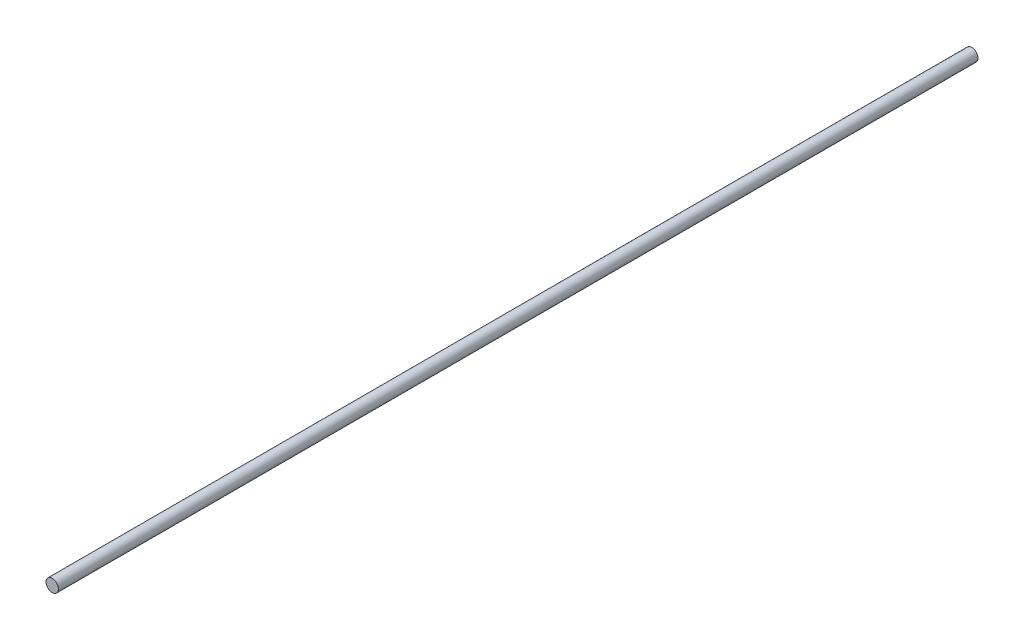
ISO-10303-21;
HEADER;
FILE_DESCRIPTION(('STEP AP214'),'2;1');
FILE_NAME('part.step','',(''),(''),'','','');
FILE_SCHEMA(('AUTOMOTIVE_DESIGN { 1 0 10303 214 1 1 1 1 }'));
ENDSEC;
DATA;
#1=APPLICATION_CONTEXT('core data for automotive mechanical design processes');
#2=APPLICATION_PROTOCOL_DEFINITION('international standard','automotive_design',2000,#1);
#3=PRODUCT_CONTEXT('',#1,'mechanical');
#4=PRODUCT('Part','Part','',(#3));
#5=PRODUCT_RELATED_PRODUCT_CATEGORY('part','',(#4));
#6=PRODUCT_DEFINITION_FORMATION('','',#4);
#7=PRODUCT_DEFINITION_CONTEXT('part definition',#1,'design');
#8=PRODUCT_DEFINITION('design','',#6,#7);
#9=PRODUCT_DEFINITION_SHAPE('','',#8);
#10=(LENGTH_UNIT() NAMED_UNIT(*) SI_UNIT(.MILLI.,.METRE.));
#11=(NAMED_UNIT(*) PLANE_ANGLE_UNIT() SI_UNIT($,.RADIAN.));
#12=(NAMED_UNIT(*) SI_UNIT($,.STERADIAN.) SOLID_ANGLE_UNIT());
#13=UNCERTAINTY_MEASURE_WITH_UNIT(LENGTH_MEASURE(1.E-05),#10,'distance_accuracy_value','');
#14=(GEOMETRIC_REPRESENTATION_CONTEXT(3) GLOBAL_UNCERTAINTY_ASSIGNED_CONTEXT((#13)) GLOBAL_UNIT_ASSIGNED_CONTEXT((#10,
#11,#12)) REPRESENTATION_CONTEXT('',''));
#15=CARTESIAN_POINT('',(0.,0.,0.));
#16=DIRECTION('',(0.,0.,1.));
#17=DIRECTION('',(1.,0.,0.));
#18=AXIS2_PLACEMENT_3D('',#15,#16,#17);
#19=CARTESIAN_POINT('',(0.,0.,-4450.));
#20=DIRECTION('',(0.,0.,1.));
#21=DIRECTION('',(1.,0.,0.));
#22=AXIS2_PLACEMENT_3D('',#19,#20,#21);
#23=CYLINDRICAL_SURFACE('',#22,30.);
#24=CARTESIAN_POINT('',(0.,0.,-4450.));
#25=DIRECTION('',(0.,0.,1.));
#26=DIRECTION('',(1.,0.,0.));
#27=AXIS2_PLACEMENT_3D('',#24,#25,#26);
#28=CIRCLE('',#27,30.);
#29=CARTESIAN_POINT('',(30.,0.,-4450.));
#30=VERTEX_POINT('',#29);
#31=EDGE_CURVE('E10',#30,#30,#28,.T.);
#32=ORIENTED_EDGE('',*,*,#31,.T.);
#33=EDGE_LOOP('',(#32));
#34=FACE_BOUND('',#33,.T.);
#35=CARTESIAN_POINT('',(0.,0.,0.));
#36=DIRECTION('',(0.,0.,1.));
#37=DIRECTION('',(1.,0.,0.));
#38=AXIS2_PLACEMENT_3D('',#35,#36,#37);
#39=CIRCLE('',#38,30.);
#40=CARTESIAN_POINT('',(30.,0.,0.));
#41=VERTEX_POINT('',#40);
#42=EDGE_CURVE('E40',#41,#41,#39,.T.);
#43=ORIENTED_EDGE('',*,*,#42,.F.);
#44=EDGE_LOOP('',(#43));
#45=FACE_BOUND('',#44,.T.);
#46=ADVANCED_FACE('F37',(#34,#45),#23,.T.);
#47=CARTESIAN_POINT('',(0.,0.,-4450.));
#48=DIRECTION('',(0.,0.,1.));
#49=DIRECTION('',(1.,0.,0.));
#50=AXIS2_PLACEMENT_3D('',#47,#48,#49);
#51=PLANE('',#50);
#52=ORIENTED_EDGE('',*,*,#31,.F.);
#53=EDGE_LOOP('',(#52));
#54=FACE_BOUND('',#53,.T.);
#55=ADVANCED_FACE('F54',(#54),#51,.F.);
#56=CARTESIAN_POINT('',(0.,0.,0.));
#57=DIRECTION('',(0.,0.,1.));
#58=DIRECTION('',(1.,0.,0.));
#59=AXIS2_PLACEMENT_3D('',#56,#57,#58);
#60=PLANE('',#59);
#61=ORIENTED_EDGE('',*,*,#42,.T.);
#62=EDGE_LOOP('',(#61));
#63=FACE_BOUND('',#62,.T.);
#64=ADVANCED_FACE('F51',(#63),#60,.T.);
#65=CLOSED_SHELL('',(#46,#55,#64));
#66=MANIFOLD_SOLID_BREP('B2',#65);
#67=ADVANCED_BREP_SHAPE_REPRESENTATION('',(#18,#66),#14);
#68=SHAPE_DEFINITION_REPRESENTATION(#9,#67);
ENDSEC;
END-ISO-10303-21;
